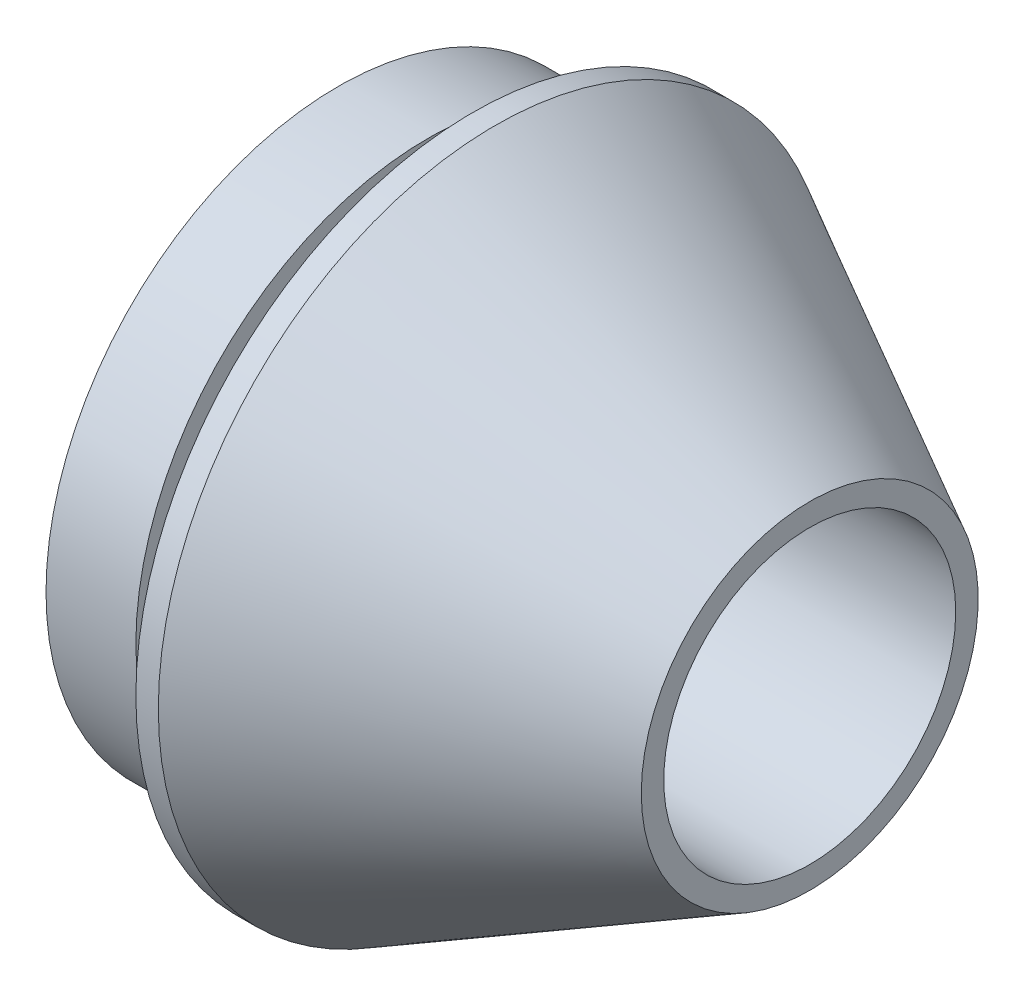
from build123d import *

# Parameters (mm, degrees)
SKETCH2_R          = 6.5
CUT_EXTRUDE1_DEPTH = 21


with BuildPart() as part:
    # Sketch1 → Revolve1 (revolve)
    with BuildSketch(Plane.XY, mode=Mode.PRIVATE) as revolve1_sk:
        Polygon((0, 0), (0, 13), (4, 13), (4, 12), (6, 12), (6, 15), (7, 15), (21, 7.5), (21, 0), align=None)
    revolve(revolve1_sk.sketch.rotate(Axis((0, 0, 0), (1, 0, 0)), 90), axis=Axis((0, 0, 0), (1, 0, 0)))

    # Sketch2 → Cut-Extrude1 (cut)
    with BuildSketch(Plane(origin=(21, 0, 0), x_dir=(0, 0, -1), z_dir=(1, 0, 0))):
        Circle(SKETCH2_R)
    extrude(amount=-CUT_EXTRUDE1_DEPTH, mode=Mode.SUBTRACT)


solid = part.part
